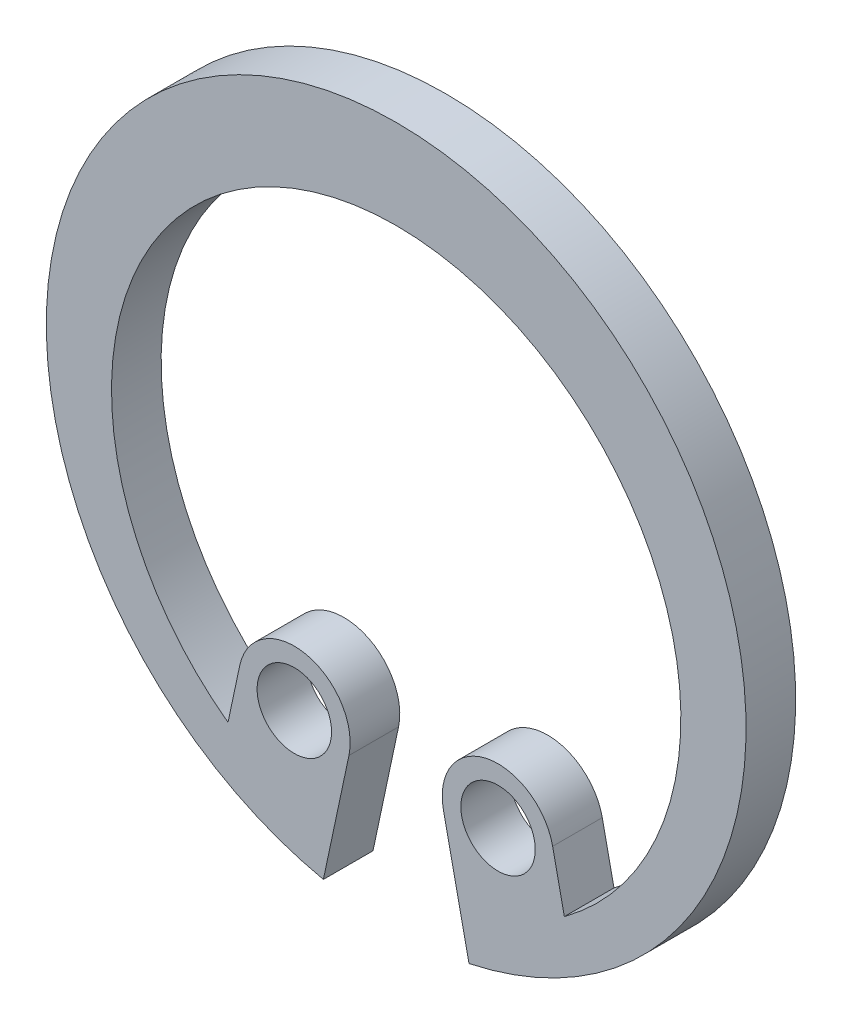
ISO-10303-21;
HEADER;
FILE_DESCRIPTION(('STEP AP214'),'2;1');
FILE_NAME('part.step','',(''),(''),'','','');
FILE_SCHEMA(('AUTOMOTIVE_DESIGN { 1 0 10303 214 1 1 1 1 }'));
ENDSEC;
DATA;
#1=APPLICATION_CONTEXT('core data for automotive mechanical design processes');
#2=APPLICATION_PROTOCOL_DEFINITION('international standard','automotive_design',2000,#1);
#3=PRODUCT_CONTEXT('',#1,'mechanical');
#4=PRODUCT('Part','Part','',(#3));
#5=PRODUCT_RELATED_PRODUCT_CATEGORY('part','',(#4));
#6=PRODUCT_DEFINITION_FORMATION('','',#4);
#7=PRODUCT_DEFINITION_CONTEXT('part definition',#1,'design');
#8=PRODUCT_DEFINITION('design','',#6,#7);
#9=PRODUCT_DEFINITION_SHAPE('','',#8);
#10=(LENGTH_UNIT() NAMED_UNIT(*) SI_UNIT(.MILLI.,.METRE.));
#11=(NAMED_UNIT(*) PLANE_ANGLE_UNIT() SI_UNIT($,.RADIAN.));
#12=(NAMED_UNIT(*) SI_UNIT($,.STERADIAN.) SOLID_ANGLE_UNIT());
#13=UNCERTAINTY_MEASURE_WITH_UNIT(LENGTH_MEASURE(1.E-05),#10,'distance_accuracy_value','');
#14=(GEOMETRIC_REPRESENTATION_CONTEXT(3) GLOBAL_UNCERTAINTY_ASSIGNED_CONTEXT((#13)) GLOBAL_UNIT_ASSIGNED_CONTEXT((#10,
#11,#12)) REPRESENTATION_CONTEXT('',''));
#15=CARTESIAN_POINT('',(0.,0.,0.));
#16=DIRECTION('',(0.,0.,1.));
#17=DIRECTION('',(1.,0.,0.));
#18=AXIS2_PLACEMENT_3D('',#15,#16,#17);
#19=CARTESIAN_POINT('',(0.,0.,0.));
#20=DIRECTION('',(0.,0.,-1.));
#21=DIRECTION('',(-1.,0.,0.));
#22=AXIS2_PLACEMENT_3D('',#19,#20,#21);
#23=PLANE('',#22);
#24=DIRECTION('',(0.208107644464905,-0.978105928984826,0.));
#25=VECTOR('',#24,1.);
#26=CARTESIAN_POINT('',(1.46715889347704,-6.89564679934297,0.));
#27=LINE('',#26,#25);
#28=CARTESIAN_POINT('',(1.46715889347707,-6.89564679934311,0.));
#29=VERTEX_POINT('',#28);
#30=CARTESIAN_POINT('',(0.952092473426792,-4.474834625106,0.));
#31=VERTEX_POINT('',#30);
#32=EDGE_CURVE('E84',#29,#31,#27,.F.);
#33=ORIENTED_EDGE('',*,*,#32,.F.);
#34=CARTESIAN_POINT('',(0.,0.,0.));
#35=DIRECTION('',(0.,0.,-1.));
#36=DIRECTION('',(-1.,0.,0.));
#37=AXIS2_PLACEMENT_3D('',#34,#35,#36);
#38=CIRCLE('',#37,7.05);
#39=CARTESIAN_POINT('',(-1.46715889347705,-6.89564679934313,0.));
#40=VERTEX_POINT('',#39);
#41=EDGE_CURVE('E77',#40,#29,#38,.T.);
#42=ORIENTED_EDGE('',*,*,#41,.F.);
#43=DIRECTION('',(-0.208107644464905,-0.978105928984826,0.));
#44=VECTOR('',#43,1.);
#45=CARTESIAN_POINT('',(-1.46715889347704,-6.89564679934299,0.));
#46=LINE('',#45,#44);
#47=CARTESIAN_POINT('',(-0.952092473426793,-4.47483462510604,0.));
#48=VERTEX_POINT('',#47);
#49=EDGE_CURVE('E81',#40,#48,#46,.F.);
#50=ORIENTED_EDGE('',*,*,#49,.T.);
#51=CARTESIAN_POINT('',(-2.05246164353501,-4.24071352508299,0.));
#52=DIRECTION('',(0.,0.,1.));
#53=DIRECTION('',(1.,0.,0.));
#54=AXIS2_PLACEMENT_3D('',#51,#52,#53);
#55=CIRCLE('',#54,1.125);
#56=CARTESIAN_POINT('',(-3.15283081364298,-4.00659242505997,0.));
#57=VERTEX_POINT('',#56);
#58=EDGE_CURVE('E132',#57,#48,#55,.F.);
#59=ORIENTED_EDGE('',*,*,#58,.F.);
#60=DIRECTION('',(0.208107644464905,0.978105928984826,0.));
#61=VECTOR('',#60,1.);
#62=CARTESIAN_POINT('',(-3.15283081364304,-4.00659242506,0.));
#63=LINE('',#62,#61);
#64=CARTESIAN_POINT('',(-3.38868425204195,-5.11510358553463,0.));
#65=VERTEX_POINT('',#64);
#66=EDGE_CURVE('E107',#57,#65,#63,.F.);
#67=ORIENTED_EDGE('',*,*,#66,.T.);
#68=CARTESIAN_POINT('',(0.,-0.486486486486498,0.));
#69=DIRECTION('',(0.,0.,-1.));
#70=DIRECTION('',(-1.,0.,0.));
#71=AXIS2_PLACEMENT_3D('',#68,#69,#70);
#72=CIRCLE('',#71,5.736486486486);
#73=CARTESIAN_POINT('',(3.38868425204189,-5.11510358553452,0.));
#74=VERTEX_POINT('',#73);
#75=EDGE_CURVE('E110',#65,#74,#72,.T.);
#76=ORIENTED_EDGE('',*,*,#75,.T.);
#77=DIRECTION('',(-0.208107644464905,0.978105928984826,0.));
#78=VECTOR('',#77,1.);
#79=CARTESIAN_POINT('',(3.15283081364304,-4.00659242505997,0.));
#80=LINE('',#79,#78);
#81=CARTESIAN_POINT('',(3.15283081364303,-4.00659242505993,0.));
#82=VERTEX_POINT('',#81);
#83=EDGE_CURVE('E111',#82,#74,#80,.F.);
#84=ORIENTED_EDGE('',*,*,#83,.F.);
#85=CARTESIAN_POINT('',(2.05246164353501,-4.24071352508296,0.));
#86=DIRECTION('',(0.,0.,-1.));
#87=DIRECTION('',(-1.,0.,0.));
#88=AXIS2_PLACEMENT_3D('',#85,#86,#87);
#89=CIRCLE('',#88,1.125);
#90=EDGE_CURVE('E136',#31,#82,#89,.T.);
#91=ORIENTED_EDGE('',*,*,#90,.F.);
#92=EDGE_LOOP('',(#33,#42,#50,#59,#67,#76,#84,#91));
#93=FACE_BOUND('',#92,.T.);
#94=CARTESIAN_POINT('',(-2.05246164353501,-4.24071352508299,0.));
#95=DIRECTION('',(0.,0.,1.));
#96=DIRECTION('',(1.,0.,0.));
#97=AXIS2_PLACEMENT_3D('',#94,#95,#96);
#98=CIRCLE('',#97,0.75);
#99=CARTESIAN_POINT('',(-1.30246164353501,-4.24071352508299,0.));
#100=VERTEX_POINT('',#99);
#101=EDGE_CURVE('E98',#100,#100,#98,.F.);
#102=ORIENTED_EDGE('',*,*,#101,.T.);
#103=EDGE_LOOP('',(#102));
#104=FACE_BOUND('',#103,.T.);
#105=CARTESIAN_POINT('',(2.05246164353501,-4.24071352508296,0.));
#106=DIRECTION('',(0.,0.,-1.));
#107=DIRECTION('',(-1.,0.,0.));
#108=AXIS2_PLACEMENT_3D('',#105,#106,#107);
#109=CIRCLE('',#108,0.75);
#110=CARTESIAN_POINT('',(1.30246164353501,-4.24071352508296,0.));
#111=VERTEX_POINT('',#110);
#112=EDGE_CURVE('E19',#111,#111,#109,.T.);
#113=ORIENTED_EDGE('',*,*,#112,.T.);
#114=EDGE_LOOP('',(#113));
#115=FACE_BOUND('',#114,.T.);
#116=ADVANCED_FACE('F16',(#93,#104,#115),#23,.F.);
#117=CARTESIAN_POINT('',(2.05246164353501,-4.24071352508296,0.));
#118=DIRECTION('',(0.,0.,-1.));
#119=DIRECTION('',(-1.,0.,0.));
#120=AXIS2_PLACEMENT_3D('',#117,#118,#119);
#121=CYLINDRICAL_SURFACE('',#120,0.75);
#122=ORIENTED_EDGE('',*,*,#112,.F.);
#123=EDGE_LOOP('',(#122));
#124=FACE_BOUND('',#123,.T.);
#125=CARTESIAN_POINT('',(2.05246164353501,-4.24071352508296,-1.));
#126=DIRECTION('',(0.,0.,-1.));
#127=DIRECTION('',(-1.,0.,0.));
#128=AXIS2_PLACEMENT_3D('',#125,#126,#127);
#129=CIRCLE('',#128,0.75);
#130=CARTESIAN_POINT('',(1.30246164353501,-4.24071352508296,-1.));
#131=VERTEX_POINT('',#130);
#132=EDGE_CURVE('E129',#131,#131,#129,.F.);
#133=ORIENTED_EDGE('',*,*,#132,.F.);
#134=EDGE_LOOP('',(#133));
#135=FACE_BOUND('',#134,.T.);
#136=ADVANCED_FACE('F143',(#124,#135),#121,.F.);
#137=CARTESIAN_POINT('',(-2.05246164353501,-4.24071352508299,0.));
#138=DIRECTION('',(0.,0.,1.));
#139=DIRECTION('',(1.,0.,0.));
#140=AXIS2_PLACEMENT_3D('',#137,#138,#139);
#141=CYLINDRICAL_SURFACE('',#140,0.75);
#142=ORIENTED_EDGE('',*,*,#101,.F.);
#143=EDGE_LOOP('',(#142));
#144=FACE_BOUND('',#143,.T.);
#145=CARTESIAN_POINT('',(-2.05246164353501,-4.24071352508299,-1.));
#146=DIRECTION('',(0.,0.,1.));
#147=DIRECTION('',(1.,0.,0.));
#148=AXIS2_PLACEMENT_3D('',#145,#146,#147);
#149=CIRCLE('',#148,0.75);
#150=CARTESIAN_POINT('',(-1.30246164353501,-4.24071352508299,-1.));
#151=VERTEX_POINT('',#150);
#152=EDGE_CURVE('E126',#151,#151,#149,.T.);
#153=ORIENTED_EDGE('',*,*,#152,.F.);
#154=EDGE_LOOP('',(#153));
#155=FACE_BOUND('',#154,.T.);
#156=ADVANCED_FACE('F146',(#144,#155),#141,.F.);
#157=CARTESIAN_POINT('',(-1.46715889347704,-6.89564679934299,0.));
#158=DIRECTION('',(-0.978105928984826,0.208107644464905,0.));
#159=DIRECTION('',(-0.208107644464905,-0.978105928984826,0.));
#160=AXIS2_PLACEMENT_3D('',#157,#158,#159);
#161=PLANE('',#160);
#162=DIRECTION('',(0.,0.,1.));
#163=VECTOR('',#162,1.);
#164=CARTESIAN_POINT('',(-0.952092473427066,-4.47483462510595,0.));
#165=LINE('',#164,#163);
#166=CARTESIAN_POINT('',(-0.952092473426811,-4.47483462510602,-1.));
#167=VERTEX_POINT('',#166);
#168=EDGE_CURVE('E97',#48,#167,#165,.F.);
#169=ORIENTED_EDGE('',*,*,#168,.F.);
#170=ORIENTED_EDGE('',*,*,#49,.F.);
#171=DIRECTION('',(0.,0.,-1.));
#172=VECTOR('',#171,1.);
#173=CARTESIAN_POINT('',(-1.46715889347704,-6.89564679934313,0.));
#174=LINE('',#173,#172);
#175=CARTESIAN_POINT('',(-1.46715889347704,-6.89564679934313,-1.));
#176=VERTEX_POINT('',#175);
#177=EDGE_CURVE('E90',#176,#40,#174,.F.);
#178=ORIENTED_EDGE('',*,*,#177,.F.);
#179=DIRECTION('',(-0.208107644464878,-0.978105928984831,0.));
#180=VECTOR('',#179,1.);
#181=CARTESIAN_POINT('',(-0.952092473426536,-4.474834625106,-1.));
#182=LINE('',#181,#180);
#183=EDGE_CURVE('E125',#167,#176,#182,.T.);
#184=ORIENTED_EDGE('',*,*,#183,.F.);
#185=EDGE_LOOP('',(#169,#170,#178,#184));
#186=FACE_BOUND('',#185,.T.);
#187=ADVANCED_FACE('F93',(#186),#161,.F.);
#188=CARTESIAN_POINT('',(0.,0.,0.));
#189=DIRECTION('',(0.,0.,-1.));
#190=DIRECTION('',(-1.,0.,0.));
#191=AXIS2_PLACEMENT_3D('',#188,#189,#190);
#192=CYLINDRICAL_SURFACE('',#191,7.05);
#193=DIRECTION('',(0.,0.,1.));
#194=VECTOR('',#193,1.);
#195=CARTESIAN_POINT('',(1.46715889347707,-6.8956467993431,0.));
#196=LINE('',#195,#194);
#197=CARTESIAN_POINT('',(1.46715889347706,-6.89564679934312,-1.));
#198=VERTEX_POINT('',#197);
#199=EDGE_CURVE('E89',#198,#29,#196,.T.);
#200=ORIENTED_EDGE('',*,*,#199,.F.);
#201=CARTESIAN_POINT('',(0.,0.,-1.));
#202=DIRECTION('',(0.,0.,-1.));
#203=DIRECTION('',(-1.,0.,0.));
#204=AXIS2_PLACEMENT_3D('',#201,#202,#203);
#205=CIRCLE('',#204,7.05);
#206=EDGE_CURVE('E101',#176,#198,#205,.T.);
#207=ORIENTED_EDGE('',*,*,#206,.F.);
#208=ORIENTED_EDGE('',*,*,#177,.T.);
#209=ORIENTED_EDGE('',*,*,#41,.T.);
#210=EDGE_LOOP('',(#200,#207,#208,#209));
#211=FACE_BOUND('',#210,.T.);
#212=ADVANCED_FACE('F100',(#211),#192,.T.);
#213=CARTESIAN_POINT('',(1.46715889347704,-6.89564679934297,0.));
#214=DIRECTION('',(-0.978105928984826,-0.208107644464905,0.));
#215=DIRECTION('',(0.208107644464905,-0.978105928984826,0.));
#216=AXIS2_PLACEMENT_3D('',#213,#214,#215);
#217=PLANE('',#216);
#218=DIRECTION('',(0.,0.,-1.));
#219=VECTOR('',#218,1.);
#220=CARTESIAN_POINT('',(0.952092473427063,-4.4748346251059,0.));
#221=LINE('',#220,#219);
#222=CARTESIAN_POINT('',(0.952092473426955,-4.47483462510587,-1.));
#223=VERTEX_POINT('',#222);
#224=EDGE_CURVE('E116',#223,#31,#221,.F.);
#225=ORIENTED_EDGE('',*,*,#224,.F.);
#226=DIRECTION('',(-0.208107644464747,0.978105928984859,0.));
#227=VECTOR('',#226,1.);
#228=CARTESIAN_POINT('',(1.46715889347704,-6.8956467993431,-1.));
#229=LINE('',#228,#227);
#230=EDGE_CURVE('E123',#198,#223,#229,.T.);
#231=ORIENTED_EDGE('',*,*,#230,.F.);
#232=ORIENTED_EDGE('',*,*,#199,.T.);
#233=ORIENTED_EDGE('',*,*,#32,.T.);
#234=EDGE_LOOP('',(#225,#231,#232,#233));
#235=FACE_BOUND('',#234,.T.);
#236=ADVANCED_FACE('F176',(#235),#217,.T.);
#237=CARTESIAN_POINT('',(2.05246164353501,-4.24071352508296,0.));
#238=DIRECTION('',(0.,0.,-1.));
#239=DIRECTION('',(-1.,0.,0.));
#240=AXIS2_PLACEMENT_3D('',#237,#238,#239);
#241=CYLINDRICAL_SURFACE('',#240,1.125);
#242=DIRECTION('',(0.,0.,1.));
#243=VECTOR('',#242,1.);
#244=CARTESIAN_POINT('',(3.15283081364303,-4.00659242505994,0.));
#245=LINE('',#244,#243);
#246=CARTESIAN_POINT('',(3.15283081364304,-4.00659242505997,-1.));
#247=VERTEX_POINT('',#246);
#248=EDGE_CURVE('E115',#247,#82,#245,.T.);
#249=ORIENTED_EDGE('',*,*,#248,.F.);
#250=CARTESIAN_POINT('',(2.05246164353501,-4.24071352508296,-1.));
#251=DIRECTION('',(0.,0.,-1.));
#252=DIRECTION('',(-1.,0.,0.));
#253=AXIS2_PLACEMENT_3D('',#250,#251,#252);
#254=CIRCLE('',#253,1.125);
#255=EDGE_CURVE('E121',#223,#247,#254,.T.);
#256=ORIENTED_EDGE('',*,*,#255,.F.);
#257=ORIENTED_EDGE('',*,*,#224,.T.);
#258=ORIENTED_EDGE('',*,*,#90,.T.);
#259=EDGE_LOOP('',(#249,#256,#257,#258));
#260=FACE_BOUND('',#259,.T.);
#261=ADVANCED_FACE('F172',(#260),#241,.T.);
#262=CARTESIAN_POINT('',(3.15283081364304,-4.00659242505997,0.));
#263=DIRECTION('',(0.978105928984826,0.208107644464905,0.));
#264=DIRECTION('',(-0.208107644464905,0.978105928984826,0.));
#265=AXIS2_PLACEMENT_3D('',#262,#263,#264);
#266=PLANE('',#265);
#267=DIRECTION('',(0.,0.,-1.));
#268=VECTOR('',#267,1.);
#269=CARTESIAN_POINT('',(3.38868425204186,-5.11510358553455,0.));
#270=LINE('',#269,#268);
#271=CARTESIAN_POINT('',(3.38868425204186,-5.11510358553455,-1.));
#272=VERTEX_POINT('',#271);
#273=EDGE_CURVE('E114',#74,#272,#270,.T.);
#274=ORIENTED_EDGE('',*,*,#273,.T.);
#275=DIRECTION('',(0.208107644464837,-0.97810592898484,0.));
#276=VECTOR('',#275,1.);
#277=CARTESIAN_POINT('',(3.15283081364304,-4.00659242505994,-1.));
#278=LINE('',#277,#276);
#279=EDGE_CURVE('E120',#247,#272,#278,.T.);
#280=ORIENTED_EDGE('',*,*,#279,.F.);
#281=ORIENTED_EDGE('',*,*,#248,.T.);
#282=ORIENTED_EDGE('',*,*,#83,.T.);
#283=EDGE_LOOP('',(#274,#280,#281,#282));
#284=FACE_BOUND('',#283,.T.);
#285=ADVANCED_FACE('F168',(#284),#266,.T.);
#286=CARTESIAN_POINT('',(0.,-0.486486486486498,0.));
#287=DIRECTION('',(0.,0.,-1.));
#288=DIRECTION('',(-1.,0.,0.));
#289=AXIS2_PLACEMENT_3D('',#286,#287,#288);
#290=CYLINDRICAL_SURFACE('',#289,5.736486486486);
#291=ORIENTED_EDGE('',*,*,#75,.F.);
#292=DIRECTION('',(0.,0.,1.));
#293=VECTOR('',#292,1.);
#294=CARTESIAN_POINT('',(-3.38868425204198,-5.11510358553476,0.));
#295=LINE('',#294,#293);
#296=CARTESIAN_POINT('',(-3.38868425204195,-5.11510358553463,-1.));
#297=VERTEX_POINT('',#296);
#298=EDGE_CURVE('E109',#65,#297,#295,.F.);
#299=ORIENTED_EDGE('',*,*,#298,.T.);
#300=CARTESIAN_POINT('',(0.,-0.486486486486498,-1.));
#301=DIRECTION('',(0.,0.,-1.));
#302=DIRECTION('',(-1.,0.,0.));
#303=AXIS2_PLACEMENT_3D('',#300,#301,#302);
#304=CIRCLE('',#303,5.736486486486);
#305=EDGE_CURVE('E118',#272,#297,#304,.F.);
#306=ORIENTED_EDGE('',*,*,#305,.F.);
#307=ORIENTED_EDGE('',*,*,#273,.F.);
#308=EDGE_LOOP('',(#291,#299,#306,#307));
#309=FACE_BOUND('',#308,.T.);
#310=ADVANCED_FACE('F165',(#309),#290,.F.);
#311=CARTESIAN_POINT('',(-3.15283081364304,-4.00659242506,0.));
#312=DIRECTION('',(0.978105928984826,-0.208107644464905,0.));
#313=DIRECTION('',(0.208107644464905,0.978105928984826,0.));
#314=AXIS2_PLACEMENT_3D('',#311,#312,#313);
#315=PLANE('',#314);
#316=ORIENTED_EDGE('',*,*,#298,.F.);
#317=ORIENTED_EDGE('',*,*,#66,.F.);
#318=DIRECTION('',(0.,0.,1.));
#319=VECTOR('',#318,1.);
#320=CARTESIAN_POINT('',(-3.15283081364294,-4.00659242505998,0.));
#321=LINE('',#320,#319);
#322=CARTESIAN_POINT('',(-3.15283081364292,-4.00659242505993,-1.));
#323=VERTEX_POINT('',#322);
#324=EDGE_CURVE('E34',#323,#57,#321,.T.);
#325=ORIENTED_EDGE('',*,*,#324,.F.);
#326=DIRECTION('',(0.208107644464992,0.978105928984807,0.));
#327=VECTOR('',#326,1.);
#328=CARTESIAN_POINT('',(-3.38868425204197,-5.11510358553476,-1.));
#329=LINE('',#328,#327);
#330=EDGE_CURVE('E25',#297,#323,#329,.T.);
#331=ORIENTED_EDGE('',*,*,#330,.F.);
#332=EDGE_LOOP('',(#316,#317,#325,#331));
#333=FACE_BOUND('',#332,.T.);
#334=ADVANCED_FACE('F158',(#333),#315,.F.);
#335=CARTESIAN_POINT('',(-2.05246164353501,-4.24071352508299,0.));
#336=DIRECTION('',(0.,0.,1.));
#337=DIRECTION('',(1.,0.,0.));
#338=AXIS2_PLACEMENT_3D('',#335,#336,#337);
#339=CYLINDRICAL_SURFACE('',#338,1.125);
#340=ORIENTED_EDGE('',*,*,#58,.T.);
#341=ORIENTED_EDGE('',*,*,#168,.T.);
#342=CARTESIAN_POINT('',(-2.05246164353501,-4.24071352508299,-1.));
#343=DIRECTION('',(0.,0.,1.));
#344=DIRECTION('',(1.,0.,0.));
#345=AXIS2_PLACEMENT_3D('',#342,#343,#344);
#346=CIRCLE('',#345,1.125);
#347=EDGE_CURVE('E11',#323,#167,#346,.F.);
#348=ORIENTED_EDGE('',*,*,#347,.F.);
#349=ORIENTED_EDGE('',*,*,#324,.T.);
#350=EDGE_LOOP('',(#340,#341,#348,#349));
#351=FACE_BOUND('',#350,.T.);
#352=ADVANCED_FACE('F151',(#351),#339,.T.);
#353=CARTESIAN_POINT('',(0.,0.,-1.));
#354=DIRECTION('',(0.,0.,-1.));
#355=DIRECTION('',(-1.,0.,0.));
#356=AXIS2_PLACEMENT_3D('',#353,#354,#355);
#357=PLANE('',#356);
#358=ORIENTED_EDGE('',*,*,#347,.T.);
#359=ORIENTED_EDGE('',*,*,#183,.T.);
#360=ORIENTED_EDGE('',*,*,#206,.T.);
#361=ORIENTED_EDGE('',*,*,#230,.T.);
#362=ORIENTED_EDGE('',*,*,#255,.T.);
#363=ORIENTED_EDGE('',*,*,#279,.T.);
#364=ORIENTED_EDGE('',*,*,#305,.T.);
#365=ORIENTED_EDGE('',*,*,#330,.T.);
#366=EDGE_LOOP('',(#358,#359,#360,#361,#362,#363,#364,#365));
#367=FACE_BOUND('',#366,.T.);
#368=ORIENTED_EDGE('',*,*,#152,.T.);
#369=EDGE_LOOP('',(#368));
#370=FACE_BOUND('',#369,.T.);
#371=ORIENTED_EDGE('',*,*,#132,.T.);
#372=EDGE_LOOP('',(#371));
#373=FACE_BOUND('',#372,.T.);
#374=ADVANCED_FACE('F149',(#367,#370,#373),#357,.T.);
#375=CLOSED_SHELL('',(#116,#136,#156,#187,#212,#236,#261,#285,#310,#334,#352,#374));
#376=MANIFOLD_SOLID_BREP('B1',#375);
#377=ADVANCED_BREP_SHAPE_REPRESENTATION('',(#18,#376),#14);
#378=SHAPE_DEFINITION_REPRESENTATION(#9,#377);
ENDSEC;
END-ISO-10303-21;
